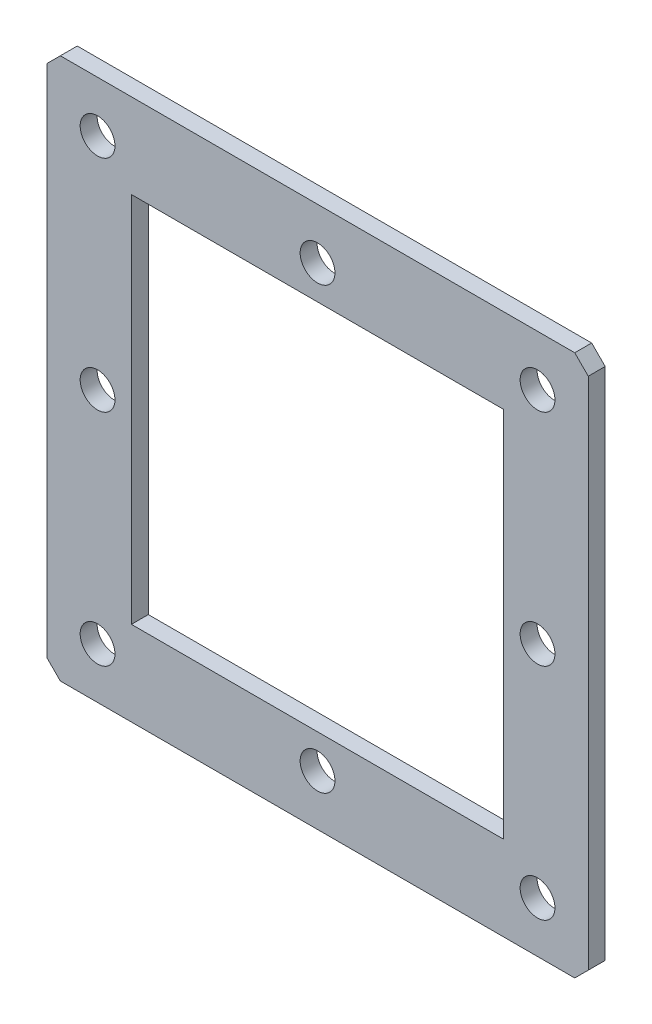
from build123d import *

# Parameters (mm, degrees)
SKETCH1_R           = 3.2639
SKETCH1_W           = 69.85
SKETCH1_H           = 69.85
BOSS_EXTRUDE1_DEPTH = 3.175


with BuildPart() as part:
    # Sketch1 → Boss-Extrude1 (new body)
    with BuildSketch(Plane.XY):
        Polygon((-50.425822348, 48.883629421), (-47.885822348, 51.423629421), (48.634177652, 51.423629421), (51.174177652, 48.883629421), (51.174177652, -47.636370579), (48.634177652, -50.176370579), (-47.885822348, -50.176370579), (-50.425822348, -47.636370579), align=None)
        with Locations((-40.900822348, 41.898629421)):
            Circle(SKETCH1_R, mode=Mode.SUBTRACT)
        with Locations((0.374177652, 41.898629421)):
            Circle(SKETCH1_R, mode=Mode.SUBTRACT)
        with Locations((41.649177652, 41.898629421)):
            Circle(SKETCH1_R, mode=Mode.SUBTRACT)
        with Locations((41.649177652, 0.623629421)):
            Circle(SKETCH1_R, mode=Mode.SUBTRACT)
        with Locations((41.649177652, -40.651370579)):
            Circle(SKETCH1_R, mode=Mode.SUBTRACT)
        with Locations((0.374177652, -40.651370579)):
            Circle(SKETCH1_R, mode=Mode.SUBTRACT)
        with Locations((-40.900822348, -40.651370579)):
            Circle(SKETCH1_R, mode=Mode.SUBTRACT)
        with Locations((-40.900822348, 0.623629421)):
            Circle(SKETCH1_R, mode=Mode.SUBTRACT)
        with Locations((0.374177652, 0.623629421)):
            Rectangle(SKETCH1_W, SKETCH1_H, mode=Mode.SUBTRACT)
    extrude(amount=BOSS_EXTRUDE1_DEPTH)


solid = part.part
